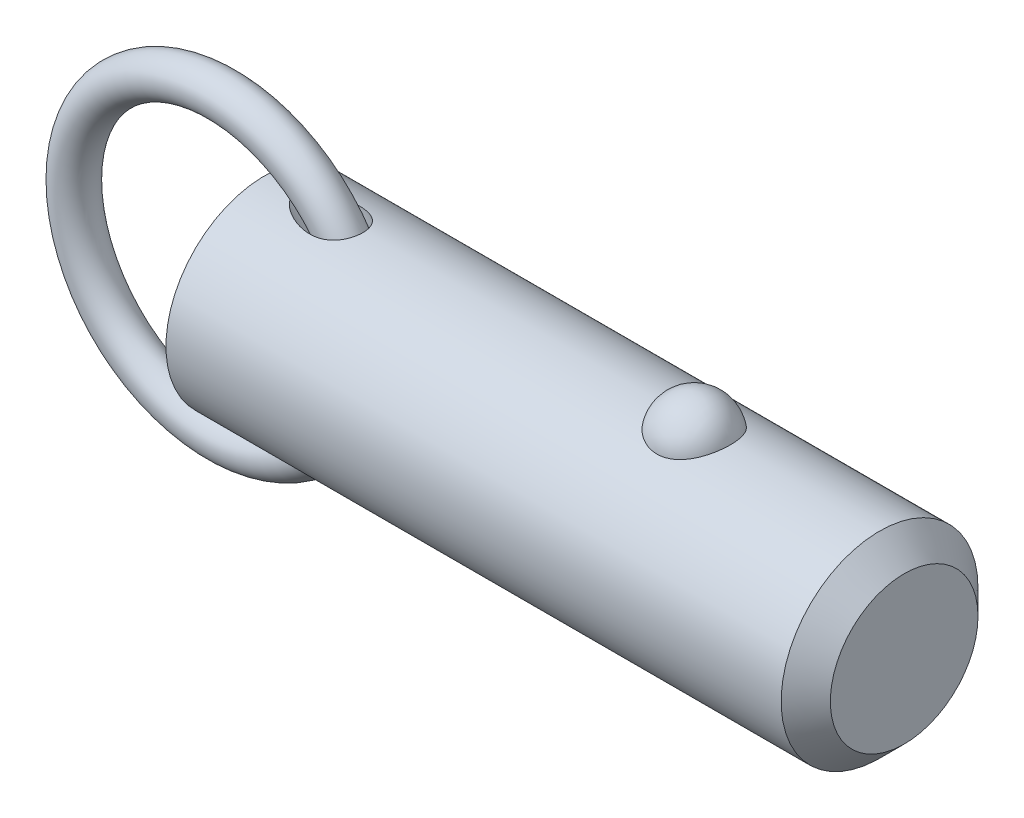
ISO-10303-21;
HEADER;
FILE_DESCRIPTION(('STEP AP214'),'2;1');
FILE_NAME('part.step','',(''),(''),'','','');
FILE_SCHEMA(('AUTOMOTIVE_DESIGN { 1 0 10303 214 1 1 1 1 }'));
ENDSEC;
DATA;
#1=APPLICATION_CONTEXT('core data for automotive mechanical design processes');
#2=APPLICATION_PROTOCOL_DEFINITION('international standard','automotive_design',2000,#1);
#3=PRODUCT_CONTEXT('',#1,'mechanical');
#4=PRODUCT('Part','Part','',(#3));
#5=PRODUCT_RELATED_PRODUCT_CATEGORY('part','',(#4));
#6=PRODUCT_DEFINITION_FORMATION('','',#4);
#7=PRODUCT_DEFINITION_CONTEXT('part definition',#1,'design');
#8=PRODUCT_DEFINITION('design','',#6,#7);
#9=PRODUCT_DEFINITION_SHAPE('','',#8);
#10=(LENGTH_UNIT() NAMED_UNIT(*) SI_UNIT(.MILLI.,.METRE.));
#11=(NAMED_UNIT(*) PLANE_ANGLE_UNIT() SI_UNIT($,.RADIAN.));
#12=(NAMED_UNIT(*) SI_UNIT($,.STERADIAN.) SOLID_ANGLE_UNIT());
#13=UNCERTAINTY_MEASURE_WITH_UNIT(LENGTH_MEASURE(1.E-05),#10,'distance_accuracy_value','');
#14=(GEOMETRIC_REPRESENTATION_CONTEXT(3) GLOBAL_UNCERTAINTY_ASSIGNED_CONTEXT((#13)) GLOBAL_UNIT_ASSIGNED_CONTEXT((#10,
#11,#12)) REPRESENTATION_CONTEXT('',''));
#15=CARTESIAN_POINT('',(0.,0.,0.));
#16=DIRECTION('',(0.,0.,1.));
#17=DIRECTION('',(1.,0.,0.));
#18=AXIS2_PLACEMENT_3D('',#15,#16,#17);
#19=CARTESIAN_POINT('',(-5.53898640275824,0.,0.));
#20=DIRECTION('',(0.,0.,1.));
#21=DIRECTION('',(1.,0.,0.));
#22=AXIS2_PLACEMENT_3D('',#19,#20,#21);
#23=TOROIDAL_SURFACE('',#22,19.05,2.54);
#24=CARTESIAN_POINT('',(16.0510135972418,0.,0.));
#25=VERTEX_POINT('',#24);
#26=VERTEX_LOOP('',#25);
#27=FACE_BOUND('',#26,.T.);
#28=ADVANCED_FACE('P0_F12',(#27),#23,.T.);
#29=CLOSED_SHELL('',(#28));
#30=MANIFOLD_SOLID_BREP('P0_B1',#29);
#31=CARTESIAN_POINT('',(0.,0.,0.));
#32=DIRECTION('',(1.,0.,0.));
#33=DIRECTION('',(0.,0.,-1.));
#34=AXIS2_PLACEMENT_3D('',#31,#32,#33);
#35=CYLINDRICAL_SURFACE('',#34,12.7);
#36=CARTESIAN_POINT('',(79.375,0.,0.));
#37=DIRECTION('',(1.,0.,0.));
#38=DIRECTION('',(0.,0.,-1.));
#39=AXIS2_PLACEMENT_3D('',#36,#37,#38);
#40=CIRCLE('',#39,12.7);
#41=CARTESIAN_POINT('',(79.375,0.,-12.7));
#42=VERTEX_POINT('',#41);
#43=EDGE_CURVE('P1_E89',#42,#42,#40,.T.);
#44=ORIENTED_EDGE('',*,*,#43,.F.);
#45=EDGE_LOOP('',(#44));
#46=FACE_BOUND('',#45,.T.);
#47=CARTESIAN_POINT('',(0.,0.,0.));
#48=DIRECTION('',(1.,0.,0.));
#49=DIRECTION('',(0.,0.,-1.));
#50=AXIS2_PLACEMENT_3D('',#47,#48,#49);
#51=CIRCLE('',#50,12.7);
#52=CARTESIAN_POINT('',(0.,0.,-12.7));
#53=VERTEX_POINT('',#52);
#54=EDGE_CURVE('P1_E52',#53,#53,#51,.T.);
#55=ORIENTED_EDGE('',*,*,#54,.T.);
#56=EDGE_LOOP('',(#55));
#57=FACE_BOUND('',#56,.T.);
#58=CARTESIAN_POINT('',(55.4600429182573,11.7500437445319,4.81938502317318));
#59=CARTESIAN_POINT('',(55.3350881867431,11.7500430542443,4.81938571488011));
#60=CARTESIAN_POINT('',(55.2101442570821,11.7520975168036,4.81438658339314));
#61=CARTESIAN_POINT('',(54.9611425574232,11.760253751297,4.79442904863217));
#62=CARTESIAN_POINT('',(54.8370850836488,11.7663568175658,4.77946746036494));
#63=CARTESIAN_POINT('',(54.5909016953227,11.7824262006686,4.73971414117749));
#64=CARTESIAN_POINT('',(54.4687744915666,11.7923898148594,4.71492928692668));
#65=CARTESIAN_POINT('',(54.2271874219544,11.8158938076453,4.65571340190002));
#66=CARTESIAN_POINT('',(54.1077285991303,11.8294355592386,4.6212786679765));
#67=CARTESIAN_POINT('',(53.8725578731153,11.8596812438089,4.54309502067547));
#68=CARTESIAN_POINT('',(53.7568393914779,11.8763792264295,4.49936361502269));
#69=CARTESIAN_POINT('',(53.5296530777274,11.9124878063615,4.40287235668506));
#70=CARTESIAN_POINT('',(53.4181868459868,11.9318994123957,4.35010914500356));
#71=CARTESIAN_POINT('',(53.0912782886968,11.9934256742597,4.17881316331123));
#72=CARTESIAN_POINT('',(52.8831270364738,12.038858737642,4.04720756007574));
#73=CARTESIAN_POINT('',(52.4858509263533,12.1352173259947,3.748564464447));
#74=CARTESIAN_POINT('',(52.2974438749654,12.1862630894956,3.58061821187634));
#75=CARTESIAN_POINT('',(51.9505213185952,12.2875163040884,3.21600758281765));
#76=CARTESIAN_POINT('',(51.7920113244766,12.3377235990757,3.0193379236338));
#77=CARTESIAN_POINT('',(51.5016887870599,12.434492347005,2.592916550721));
#78=CARTESIAN_POINT('',(51.3713762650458,12.4807925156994,2.36208286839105));
#79=CARTESIAN_POINT('',(51.1494079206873,12.5623454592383,1.88070399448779));
#80=CARTESIAN_POINT('',(51.0577554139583,12.5975972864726,1.63015711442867));
#81=CARTESIAN_POINT('',(50.9140466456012,12.6538414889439,1.11298869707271));
#82=CARTESIAN_POINT('',(50.8624990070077,12.6746503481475,0.84620552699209));
#83=CARTESIAN_POINT('',(50.8019771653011,12.699153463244,0.307085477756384));
#84=CARTESIAN_POINT('',(50.7930018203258,12.7028481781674,0.0347487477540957));
#85=CARTESIAN_POINT('',(50.8177310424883,12.6927785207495,-0.506073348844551));
#86=CARTESIAN_POINT('',(50.8511899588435,12.6791146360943,-0.774571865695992));
#87=CARTESIAN_POINT('',(50.9596877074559,12.635882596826,-1.30170246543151));
#88=CARTESIAN_POINT('',(51.0347272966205,12.6063141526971,-1.5603343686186));
#89=CARTESIAN_POINT('',(51.2250000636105,12.5342328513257,-2.06083899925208));
#90=CARTESIAN_POINT('',(51.3402872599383,12.4917026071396,-2.3026886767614));
#91=CARTESIAN_POINT('',(51.6087044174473,12.3981123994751,-2.76259600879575));
#92=CARTESIAN_POINT('',(51.7618374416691,12.3470517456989,-2.98065173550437));
#93=CARTESIAN_POINT('',(52.1035077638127,12.2416045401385,-3.38786328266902));
#94=CARTESIAN_POINT('',(52.2922017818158,12.1872040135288,-3.57688418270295));
#95=CARTESIAN_POINT('',(52.7002392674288,12.0814086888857,-3.91941073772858));
#96=CARTESIAN_POINT('',(52.9195800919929,12.0300136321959,-4.07291945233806));
#97=CARTESIAN_POINT('',(53.3783753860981,11.9373542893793,-4.33691289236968));
#98=CARTESIAN_POINT('',(53.6173044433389,11.8958982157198,-4.44824125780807));
#99=CARTESIAN_POINT('',(54.1124376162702,11.8268116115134,-4.62881985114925));
#100=CARTESIAN_POINT('',(54.3686351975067,11.7991758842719,-4.69808589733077));
#101=CARTESIAN_POINT('',(54.8771640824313,11.7622209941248,-4.78983181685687));
#102=CARTESIAN_POINT('',(55.1290414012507,11.7520502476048,-4.81449025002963));
#103=CARTESIAN_POINT('',(55.6335734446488,11.7485796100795,-4.82295735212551));
#104=CARTESIAN_POINT('',(55.8862280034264,11.7552763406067,-4.80677420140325));
#105=CARTESIAN_POINT('',(56.3768341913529,11.7842584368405,-4.73525430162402));
#106=CARTESIAN_POINT('',(56.6149984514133,11.8060486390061,-4.68116061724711));
#107=CARTESIAN_POINT('',(57.0784894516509,11.8622750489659,-4.53678133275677));
#108=CARTESIAN_POINT('',(57.3038151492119,11.8967122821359,-4.44649279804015));
#109=CARTESIAN_POINT('',(57.7408018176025,11.9754603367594,-4.2298761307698));
#110=CARTESIAN_POINT('',(57.9520579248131,12.0199699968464,-4.10280539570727));
#111=CARTESIAN_POINT('',(58.3506012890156,12.1138028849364,-3.81685409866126));
#112=CARTESIAN_POINT('',(58.5378830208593,12.163127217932,-3.65796622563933));
#113=CARTESIAN_POINT('',(58.8933509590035,12.2642343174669,-3.30364864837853));
#114=CARTESIAN_POINT('',(59.0601119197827,12.3160165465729,-3.10678783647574));
#115=CARTESIAN_POINT('',(59.3595799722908,12.4142566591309,-2.68748409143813));
#116=CARTESIAN_POINT('',(59.4922809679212,12.4607135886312,-2.46503658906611));
#117=CARTESIAN_POINT('',(59.7246912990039,12.5450236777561,-1.9928951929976));
#118=CARTESIAN_POINT('',(59.823215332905,12.5825557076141,-1.7425591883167));
#119=CARTESIAN_POINT('',(59.9792277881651,12.6431720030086,-1.22773734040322));
#120=CARTESIAN_POINT('',(60.0367157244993,12.6662560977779,-0.963251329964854));
#121=CARTESIAN_POINT('',(60.1095441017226,12.6956486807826,-0.427355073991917));
#122=CARTESIAN_POINT('',(60.1248378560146,12.7019385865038,-0.1559374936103));
#123=CARTESIAN_POINT('',(60.1127794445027,12.6970201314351,0.385928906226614));
#124=CARTESIAN_POINT('',(60.0854280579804,12.6858120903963,0.656377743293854));
#125=CARTESIAN_POINT('',(60.0130609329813,12.6568455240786,1.05454017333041));
#126=CARTESIAN_POINT('',(59.9837963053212,12.6451962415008,1.18577850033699));
#127=CARTESIAN_POINT('',(59.9150228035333,12.6181819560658,1.4451380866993));
#128=CARTESIAN_POINT('',(59.8755176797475,12.6028183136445,1.57326046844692));
#129=CARTESIAN_POINT('',(59.7864397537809,12.5687547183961,1.82554978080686));
#130=CARTESIAN_POINT('',(59.7368627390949,12.5500533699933,1.9497150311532));
#131=CARTESIAN_POINT('',(59.6279211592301,12.5098093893,2.19314370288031));
#132=CARTESIAN_POINT('',(59.5685601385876,12.4882677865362,2.31240887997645));
#133=CARTESIAN_POINT('',(59.4399712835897,12.4427679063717,2.54593031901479));
#134=CARTESIAN_POINT('',(59.3706888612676,12.4187964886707,2.66015396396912));
#135=CARTESIAN_POINT('',(59.222903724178,12.3691892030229,2.88202659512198));
#136=CARTESIAN_POINT('',(59.1444044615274,12.3435539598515,2.98967802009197));
#137=CARTESIAN_POINT('',(58.9785502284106,12.2912955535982,3.19774385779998));
#138=CARTESIAN_POINT('',(58.8911918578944,12.2646720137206,3.29815546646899));
#139=CARTESIAN_POINT('',(58.7081617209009,12.2111945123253,3.49095035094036));
#140=CARTESIAN_POINT('',(58.6124932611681,12.1843406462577,3.58333679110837));
#141=CARTESIAN_POINT('',(58.4136272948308,12.1312249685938,3.75922876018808));
#142=CARTESIAN_POINT('',(58.3104503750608,12.104961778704,3.84275713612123));
#143=CARTESIAN_POINT('',(58.0970133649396,12.0537284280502,4.00056406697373));
#144=CARTESIAN_POINT('',(57.9867562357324,12.028757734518,4.07484645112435));
#145=CARTESIAN_POINT('',(57.7597550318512,11.9808306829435,4.21367959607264));
#146=CARTESIAN_POINT('',(57.6430068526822,11.9578756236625,4.27822410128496));
#147=CARTESIAN_POINT('',(57.4039425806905,11.9147184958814,4.39698483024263));
#148=CARTESIAN_POINT('',(57.2816287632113,11.894515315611,4.45120522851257));
#149=CARTESIAN_POINT('',(57.0229527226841,11.8561129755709,4.55255353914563));
#150=CARTESIAN_POINT('',(56.8862237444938,11.8381764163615,4.59884858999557));
#151=CARTESIAN_POINT('',(56.6086087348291,11.8069093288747,4.67853897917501));
#152=CARTESIAN_POINT('',(56.4677245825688,11.7935767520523,4.71194005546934));
#153=CARTESIAN_POINT('',(56.1830944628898,11.7720277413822,4.76552188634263));
#154=CARTESIAN_POINT('',(56.0393488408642,11.7638106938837,4.78570422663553));
#155=CARTESIAN_POINT('',(55.7504114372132,11.7528195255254,4.81263433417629));
#156=CARTESIAN_POINT('',(55.6052198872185,11.7500445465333,4.81938421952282));
#157=CARTESIAN_POINT('',(55.4600429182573,11.7500437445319,4.81938502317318));
#158=B_SPLINE_CURVE_WITH_KNOTS('',3,(#58,#59,#60,#61,#62,#63,#64,#65,#66,#67,#68,#69,#70,#71,
#72,#73,#74,#75,#76,#77,#78,#79,#80,#81,#82,#83,#84,#85,#86,#87,#88,#89,#90,#91,#92,#93,#94,#95,
#96,#97,#98,#99,#100,#101,#102,#103,#104,#105,#106,#107,#108,#109,#110,#111,#112,#113,#114,#115,
#116,#117,#118,#119,#120,#121,#122,#123,#124,#125,#126,#127,#128,#129,#130,#131,#132,#133,#134,
#135,#136,#137,#138,#139,#140,#141,#142,#143,#144,#145,#146,#147,#148,#149,#150,#151,#152,#153,
#154,#155,#156,#157),.UNSPECIFIED.,.T.,.F.,(4,2,2,2,2,2,2,2,2,2,2,2,2,2,2,2,2,2,2,2,2,2,2,2,2,2,
2,2,2,2,2,2,2,2,2,2,2,2,2,2,2,2,2,2,2,2,2,2,2,4),(0.,0.374729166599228,0.749578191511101,
1.12416526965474,1.49889629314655,1.87292776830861,2.24709865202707,2.99481328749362,
3.76399449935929,4.53331735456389,5.3368391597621,6.14042986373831,6.95405296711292,
7.7676542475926,8.57656703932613,9.38549455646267,10.1955119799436,11.0055949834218,
11.8193353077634,12.6330054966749,13.4294141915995,14.2255231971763,14.9815786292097,
15.7374826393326,16.4696948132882,17.2019663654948,17.9501979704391,18.6986017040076,
19.4844704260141,20.2704797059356,21.0815215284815,21.8925729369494,22.7045213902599,
23.5164550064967,23.9209608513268,24.3253187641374,24.7298461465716,25.1342272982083,
25.54092555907,25.9474719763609,26.3541750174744,26.7607169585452,27.1661834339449,
27.5714814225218,27.9770386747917,28.3824315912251,28.8181206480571,29.2536155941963,
29.6890582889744,30.1244323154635),.UNSPECIFIED.);
#159=CARTESIAN_POINT('',(55.4600429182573,11.7500437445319,4.81938502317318));
#160=VERTEX_POINT('',#159);
#161=EDGE_CURVE('P1_E80',#160,#160,#158,.T.);
#162=ORIENTED_EDGE('',*,*,#161,.T.);
#163=EDGE_LOOP('',(#162));
#164=FACE_BOUND('',#163,.T.);
#165=CARTESIAN_POINT('',(-5.53898640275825,0.,0.));
#166=DIRECTION('',(0.796400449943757,-0.604769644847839,0.));
#167=DIRECTION('',(0.604769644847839,0.796400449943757,0.));
#168=AXIS2_PLACEMENT_3D('',#165,#166,#167);
#169=ELLIPSE('',#168,15.9467514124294,12.7);
#170=CARTESIAN_POINT('',(4.0948214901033,12.6864319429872,0.586893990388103));
#171=VERTEX_POINT('',#170);
#172=CARTESIAN_POINT('',(4.0948214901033,12.6864319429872,-0.586893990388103));
#173=VERTEX_POINT('',#172);
#174=EDGE_CURVE('P1_E47',#171,#173,#169,.F.);
#175=ORIENTED_EDGE('',*,*,#174,.T.);
#176=CARTESIAN_POINT('',(4.0615317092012,12.6905758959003,-0.489166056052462));
#177=CARTESIAN_POINT('',(4.08111374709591,12.6881366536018,-0.552489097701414));
#178=CARTESIAN_POINT('',(4.10417851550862,12.6852663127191,-0.614604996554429));
#179=CARTESIAN_POINT('',(4.15628434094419,12.6787965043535,-0.736067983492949));
#180=CARTESIAN_POINT('',(4.18531032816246,12.6751988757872,-0.795421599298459));
#181=CARTESIAN_POINT('',(4.2791115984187,12.6636052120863,-0.967590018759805));
#182=CARTESIAN_POINT('',(4.35123408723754,12.654730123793,-1.07635920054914));
#183=CARTESIAN_POINT('',(4.49106800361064,12.6376715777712,-1.25922957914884));
#184=CARTESIAN_POINT('',(4.55601066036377,12.6297947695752,-1.33556751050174));
#185=CARTESIAN_POINT('',(4.69223626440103,12.6134116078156,-1.48232741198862));
#186=CARTESIAN_POINT('',(4.76352147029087,12.6049050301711,-1.552747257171));
#187=CARTESIAN_POINT('',(4.911639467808,12.587417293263,-1.68868704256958));
#188=CARTESIAN_POINT('',(4.98851399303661,12.5784327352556,-1.75416062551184));
#189=CARTESIAN_POINT('',(5.14630057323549,12.560235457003,-1.88003275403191));
#190=CARTESIAN_POINT('',(5.22721398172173,12.5510226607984,-1.94042957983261));
#191=CARTESIAN_POINT('',(5.45368877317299,12.5256514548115,-2.09966332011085));
#192=CARTESIAN_POINT('',(5.6026161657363,12.5094182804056,-2.1937198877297));
#193=CARTESIAN_POINT('',(5.9079554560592,12.4774211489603,-2.36893890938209));
#194=CARTESIAN_POINT('',(6.06437232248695,12.4616575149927,-2.45009264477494));
#195=CARTESIAN_POINT('',(6.38306132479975,12.431227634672,-2.60008249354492));
#196=CARTESIAN_POINT('',(6.54533237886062,12.4165611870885,-2.66892086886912));
#197=CARTESIAN_POINT('',(6.8746261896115,12.3889351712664,-2.7943519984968));
#198=CARTESIAN_POINT('',(7.04164773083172,12.3759751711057,-2.85094785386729));
#199=CARTESIAN_POINT('',(7.38726647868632,12.3518460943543,-2.95377962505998));
#200=CARTESIAN_POINT('',(7.5660457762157,12.3407843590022,-2.99943209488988));
#201=CARTESIAN_POINT('',(7.9269869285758,12.3219309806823,-3.075966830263));
#202=CARTESIAN_POINT('',(8.109149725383,12.314140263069,-3.10684491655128));
#203=CARTESIAN_POINT('',(8.47511457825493,12.3025918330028,-3.152268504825));
#204=CARTESIAN_POINT('',(8.65890979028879,12.2988216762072,-3.16686440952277));
#205=CARTESIAN_POINT('',(9.02696087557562,12.2959421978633,-3.17802250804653));
#206=CARTESIAN_POINT('',(9.21121628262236,12.2968292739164,-3.17459864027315));
#207=CARTESIAN_POINT('',(9.61636263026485,12.3045198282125,-3.14471110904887));
#208=CARTESIAN_POINT('',(9.83695552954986,12.3125080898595,-3.11363232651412));
#209=CARTESIAN_POINT('',(10.1619126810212,12.3303028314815,-3.04206574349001));
#210=CARTESIAN_POINT('',(10.2692747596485,12.3372061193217,-3.01403983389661));
#211=CARTESIAN_POINT('',(10.4811758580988,12.3528538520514,-2.94925947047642));
#212=CARTESIAN_POINT('',(10.5857162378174,12.361597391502,-2.91250930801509));
#213=CARTESIAN_POINT('',(10.7921321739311,12.3808585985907,-2.82951748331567));
#214=CARTESIAN_POINT('',(10.8939665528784,12.3913944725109,-2.78317723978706));
#215=CARTESIAN_POINT('',(11.092611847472,12.4138762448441,-2.6811200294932));
#216=CARTESIAN_POINT('',(11.1894254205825,12.4258213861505,-2.62540809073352));
#217=CARTESIAN_POINT('',(11.3768740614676,12.4507225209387,-2.50465655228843));
#218=CARTESIAN_POINT('',(11.46751150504,12.4636781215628,-2.43962056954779));
#219=CARTESIAN_POINT('',(11.6414572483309,12.4901070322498,-2.30048560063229));
#220=CARTESIAN_POINT('',(11.7247669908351,12.5035802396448,-2.22638840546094));
#221=CARTESIAN_POINT('',(11.8713131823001,12.5285000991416,-2.08117367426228));
#222=CARTESIAN_POINT('',(11.9357009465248,12.5399538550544,-2.01121596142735));
#223=CARTESIAN_POINT('',(12.0576805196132,12.5624496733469,-1.86555293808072));
#224=CARTESIAN_POINT('',(12.1152732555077,12.5734917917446,-1.78984841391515));
#225=CARTESIAN_POINT('',(12.223073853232,12.5947858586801,-1.6332788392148));
#226=CARTESIAN_POINT('',(12.2732844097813,12.6050380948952,-1.55241568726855));
#227=CARTESIAN_POINT('',(12.3658430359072,12.6243983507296,-1.38621267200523));
#228=CARTESIAN_POINT('',(12.4081916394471,12.6335064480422,-1.30087311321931));
#229=CARTESIAN_POINT('',(12.5150098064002,12.6569076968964,-1.05702619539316));
#230=CARTESIAN_POINT('',(12.5703399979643,12.6695746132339,-0.894232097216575));
#231=CARTESIAN_POINT('',(12.6526225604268,12.6886816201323,-0.56139175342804));
#232=CARTESIAN_POINT('',(12.6795825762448,12.6951233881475,-0.391347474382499));
#233=CARTESIAN_POINT('',(12.7041016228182,12.7009766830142,-0.0537636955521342));
#234=CARTESIAN_POINT('',(12.7024538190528,12.7005778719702,0.113714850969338));
#235=CARTESIAN_POINT('',(12.6717240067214,12.6932548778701,0.445979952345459));
#236=CARTESIAN_POINT('',(12.6426435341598,12.6863310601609,0.610766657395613));
#237=CARTESIAN_POINT('',(12.5579769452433,12.6667465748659,0.932429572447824));
#238=CARTESIAN_POINT('',(12.5024793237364,12.6541050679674,1.08933027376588));
#239=CARTESIAN_POINT('',(12.3665691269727,12.6244558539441,1.39146752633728));
#240=CARTESIAN_POINT('',(12.2861577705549,12.6074483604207,1.53670464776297));
#241=CARTESIAN_POINT('',(12.1018203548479,12.5706804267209,1.81319588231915));
#242=CARTESIAN_POINT('',(11.9976588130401,12.5508932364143,1.94428915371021));
#243=CARTESIAN_POINT('',(11.7695265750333,12.5107540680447,2.1877605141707));
#244=CARTESIAN_POINT('',(11.6455540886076,12.4904020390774,2.30013691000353));
#245=CARTESIAN_POINT('',(11.3759347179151,12.4502278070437,2.50870972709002));
#246=CARTESIAN_POINT('',(11.2295880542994,12.4304654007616,2.60400962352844));
#247=CARTESIAN_POINT('',(10.9239803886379,12.3941696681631,2.77162929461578));
#248=CARTESIAN_POINT('',(10.7647152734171,12.3776373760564,2.84394171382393));
#249=CARTESIAN_POINT('',(10.4192039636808,12.3473062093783,2.97303525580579));
#250=CARTESIAN_POINT('',(10.231933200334,12.3340204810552,3.02717164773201));
#251=CARTESIAN_POINT('',(9.85152982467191,12.3134301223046,3.10986173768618));
#252=CARTESIAN_POINT('',(9.65839336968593,12.3061295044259,3.13839827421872));
#253=CARTESIAN_POINT('',(9.31022514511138,12.2982822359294,3.16897517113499));
#254=CARTESIAN_POINT('',(9.15555718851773,12.2966525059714,3.1752689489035));
#255=CARTESIAN_POINT('',(8.84618945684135,12.2967963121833,3.17471335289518));
#256=CARTESIAN_POINT('',(8.69148970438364,12.2985715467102,3.16785742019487));
#257=CARTESIAN_POINT('',(8.38280471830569,12.3051648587,3.14214692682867));
#258=CARTESIAN_POINT('',(8.22882218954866,12.3099904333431,3.12326280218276));
#259=CARTESIAN_POINT('',(7.92276070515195,12.3222644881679,3.07448013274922));
#260=CARTESIAN_POINT('',(7.77068148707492,12.3297126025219,3.04458312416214));
#261=CARTESIAN_POINT('',(7.46452663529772,12.3470493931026,2.97350781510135));
#262=CARTESIAN_POINT('',(7.31052714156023,12.3570043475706,2.93201910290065));
#263=CARTESIAN_POINT('',(7.00579083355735,12.3787609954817,2.83876185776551));
#264=CARTESIAN_POINT('',(6.85505451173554,12.3905629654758,2.78699178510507));
#265=CARTESIAN_POINT('',(6.55781208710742,12.415528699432,2.67357744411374));
#266=CARTESIAN_POINT('',(6.41129783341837,12.4286895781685,2.6119539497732));
#267=CARTESIAN_POINT('',(6.12302950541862,12.4559398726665,2.47874512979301));
#268=CARTESIAN_POINT('',(5.9812739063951,12.4700289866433,2.40716303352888));
#269=CARTESIAN_POINT('',(5.67073126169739,12.5020754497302,2.23550426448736));
#270=CARTESIAN_POINT('',(5.50343839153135,12.5201625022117,2.13268685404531));
#271=CARTESIAN_POINT('',(5.26147616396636,12.5471537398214,1.96522579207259));
#272=CARTESIAN_POINT('',(5.18224299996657,12.5561365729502,1.90713440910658));
#273=CARTESIAN_POINT('',(5.02746475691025,12.573912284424,1.78618989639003));
#274=CARTESIAN_POINT('',(4.95191912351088,12.5827051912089,1.72333748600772));
#275=CARTESIAN_POINT('',(4.81787163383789,12.598469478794,1.60360864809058));
#276=CARTESIAN_POINT('',(4.75865966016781,12.6054958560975,1.54753994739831));
#277=CARTESIAN_POINT('',(4.64406285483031,12.6191906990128,1.43158546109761));
#278=CARTESIAN_POINT('',(4.58867926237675,12.6258590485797,1.37169845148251));
#279=CARTESIAN_POINT('',(4.43014912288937,12.6450546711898,1.18656670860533));
#280=CARTESIAN_POINT('',(4.33372726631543,12.6568788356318,1.05507993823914));
#281=CARTESIAN_POINT('',(4.21252055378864,12.6718304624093,0.848052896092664));
#282=CARTESIAN_POINT('',(4.17660155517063,12.6762773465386,0.779100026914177));
#283=CARTESIAN_POINT('',(4.11264979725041,12.6842122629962,0.637080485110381));
#284=CARTESIAN_POINT('',(4.08466792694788,12.6876941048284,0.563990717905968));
#285=CARTESIAN_POINT('',(4.0615317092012,12.6905758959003,0.489166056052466));
#286=B_SPLINE_CURVE_WITH_KNOTS('',3,(#176,#177,#178,#179,#180,#181,#182,#183,#184,#185,#186,
#187,#188,#189,#190,#191,#192,#193,#194,#195,#196,#197,#198,#199,#200,#201,#202,#203,#204,#205,
#206,#207,#208,#209,#210,#211,#212,#213,#214,#215,#216,#217,#218,#219,#220,#221,#222,#223,#224,
#225,#226,#227,#228,#229,#230,#231,#232,#233,#234,#235,#236,#237,#238,#239,#240,#241,#242,#243,
#244,#245,#246,#247,#248,#249,#250,#251,#252,#253,#254,#255,#256,#257,#258,#259,#260,#261,#262,
#263,#264,#265,#266,#267,#268,#269,#270,#271,#272,#273,#274,#275,#276,#277,#278,#279,#280,#281,
#282,#283,#284,#285),.UNSPECIFIED.,.F.,.F.,(4,2,2,2,2,2,2,2,2,2,2,2,2,2,2,2,2,2,2,2,2,2,2,2,2,2,
2,2,2,2,2,2,2,2,2,2,2,2,2,2,2,2,2,2,2,2,2,2,2,2,2,2,2,2,4),(0.,0.198708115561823,
0.396919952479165,0.787580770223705,1.08882492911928,1.39017679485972,1.6940713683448,
1.99806847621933,2.52793143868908,3.05815092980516,3.58827293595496,4.11826050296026,
4.67218806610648,5.22627222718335,5.77863637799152,6.33057333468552,6.99657211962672,
7.32977411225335,7.66281254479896,7.99946156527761,8.33593054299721,8.67226935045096,
9.00854178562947,9.29544181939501,9.58230266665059,9.86905853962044,10.155794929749,
10.6702338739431,11.1845341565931,11.6845985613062,12.1846349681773,12.6830079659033,
13.1813565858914,13.68487951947,14.1884479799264,14.713533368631,15.2387866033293,
15.8228373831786,16.407279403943,16.8710810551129,17.3351141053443,17.8002921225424,
18.2654052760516,18.7444169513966,19.2235004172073,19.7015868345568,20.1795185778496,
20.7699825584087,21.0658110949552,21.3615950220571,21.6069574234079,21.8523988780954,
22.3397467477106,22.5729183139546,22.8075527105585),.UNSPECIFIED.);
#287=EDGE_CURVE('P1_E51',#173,#171,#286,.T.);
#288=ORIENTED_EDGE('',*,*,#287,.T.);
#289=EDGE_LOOP('',(#175,#288));
#290=FACE_BOUND('',#289,.T.);
#291=CARTESIAN_POINT('',(-5.53898640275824,0.,0.));
#292=DIRECTION('',(-0.796400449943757,-0.604769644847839,0.));
#293=DIRECTION('',(0.604769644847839,-0.796400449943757,0.));
#294=AXIS2_PLACEMENT_3D('',#291,#292,#293);
#295=ELLIPSE('',#294,15.9467514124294,12.7);
#296=CARTESIAN_POINT('',(4.09482149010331,-12.6864319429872,0.586893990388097));
#297=VERTEX_POINT('',#296);
#298=CARTESIAN_POINT('',(4.09482149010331,-12.6864319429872,-0.586893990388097));
#299=VERTEX_POINT('',#298);
#300=EDGE_CURVE('P1_E28',#297,#299,#295,.F.);
#301=ORIENTED_EDGE('',*,*,#300,.F.);
#302=CARTESIAN_POINT('',(4.0615317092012,-12.6905758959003,0.489166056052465));
#303=CARTESIAN_POINT('',(4.08111374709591,-12.6881366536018,0.552489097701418));
#304=CARTESIAN_POINT('',(4.10417851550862,-12.6852663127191,0.614604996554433));
#305=CARTESIAN_POINT('',(4.15628434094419,-12.6787965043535,0.736067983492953));
#306=CARTESIAN_POINT('',(4.18531032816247,-12.6751988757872,0.795421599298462));
#307=CARTESIAN_POINT('',(4.2791115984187,-12.6636052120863,0.967590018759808));
#308=CARTESIAN_POINT('',(4.35123408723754,-12.654730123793,1.07635920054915));
#309=CARTESIAN_POINT('',(4.49106800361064,-12.6376715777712,1.25922957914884));
#310=CARTESIAN_POINT('',(4.55601066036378,-12.6297947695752,1.33556751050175));
#311=CARTESIAN_POINT('',(4.69223626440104,-12.6134116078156,1.48232741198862));
#312=CARTESIAN_POINT('',(4.76352147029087,-12.6049050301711,1.552747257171));
#313=CARTESIAN_POINT('',(4.911639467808,-12.587417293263,1.68868704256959));
#314=CARTESIAN_POINT('',(4.98851399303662,-12.5784327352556,1.75416062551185));
#315=CARTESIAN_POINT('',(5.1463005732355,-12.560235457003,1.88003275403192));
#316=CARTESIAN_POINT('',(5.22721398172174,-12.5510226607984,1.94042957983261));
#317=CARTESIAN_POINT('',(5.453688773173,-12.5256514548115,2.09966332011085));
#318=CARTESIAN_POINT('',(5.60261616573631,-12.5094182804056,2.19371988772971));
#319=CARTESIAN_POINT('',(5.90795545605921,-12.4774211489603,2.36893890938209));
#320=CARTESIAN_POINT('',(6.06437232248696,-12.4616575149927,2.45009264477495));
#321=CARTESIAN_POINT('',(6.38306132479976,-12.431227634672,2.60008249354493));
#322=CARTESIAN_POINT('',(6.54533237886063,-12.4165611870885,2.66892086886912));
#323=CARTESIAN_POINT('',(6.87462618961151,-12.3889351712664,2.79435199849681));
#324=CARTESIAN_POINT('',(7.04164773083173,-12.3759751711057,2.85094785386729));
#325=CARTESIAN_POINT('',(7.38726647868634,-12.3518460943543,2.95377962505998));
#326=CARTESIAN_POINT('',(7.56604577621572,-12.3407843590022,2.99943209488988));
#327=CARTESIAN_POINT('',(7.92698692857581,-12.3219309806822,3.075966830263));
#328=CARTESIAN_POINT('',(8.10914972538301,-12.314140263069,3.10684491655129));
#329=CARTESIAN_POINT('',(8.47511457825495,-12.3025918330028,3.152268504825));
#330=CARTESIAN_POINT('',(8.65890979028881,-12.2988216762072,3.16686440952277));
#331=CARTESIAN_POINT('',(9.02696087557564,-12.2959421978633,3.17802250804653));
#332=CARTESIAN_POINT('',(9.21121628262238,-12.2968292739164,3.17459864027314));
#333=CARTESIAN_POINT('',(9.61636263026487,-12.3045198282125,3.14471110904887));
#334=CARTESIAN_POINT('',(9.83695552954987,-12.3125080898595,3.11363232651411));
#335=CARTESIAN_POINT('',(10.1619126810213,-12.3303028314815,3.04206574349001));
#336=CARTESIAN_POINT('',(10.2692747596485,-12.3372061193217,3.01403983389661));
#337=CARTESIAN_POINT('',(10.4811758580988,-12.3528538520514,2.94925947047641));
#338=CARTESIAN_POINT('',(10.5857162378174,-12.361597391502,2.91250930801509));
#339=CARTESIAN_POINT('',(10.7921321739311,-12.3808585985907,2.82951748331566));
#340=CARTESIAN_POINT('',(10.8939665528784,-12.3913944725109,2.78317723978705));
#341=CARTESIAN_POINT('',(11.092611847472,-12.4138762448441,2.6811200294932));
#342=CARTESIAN_POINT('',(11.1894254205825,-12.4258213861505,2.62540809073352));
#343=CARTESIAN_POINT('',(11.3768740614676,-12.4507225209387,2.50465655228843));
#344=CARTESIAN_POINT('',(11.46751150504,-12.4636781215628,2.43962056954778));
#345=CARTESIAN_POINT('',(11.6414572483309,-12.4901070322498,2.30048560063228));
#346=CARTESIAN_POINT('',(11.7247669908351,-12.5035802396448,2.22638840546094));
#347=CARTESIAN_POINT('',(11.8713131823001,-12.5285000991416,2.08117367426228));
#348=CARTESIAN_POINT('',(11.9357009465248,-12.5399538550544,2.01121596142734));
#349=CARTESIAN_POINT('',(12.0576805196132,-12.5624496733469,1.86555293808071));
#350=CARTESIAN_POINT('',(12.1152732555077,-12.5734917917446,1.78984841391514));
#351=CARTESIAN_POINT('',(12.223073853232,-12.5947858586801,1.63327883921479));
#352=CARTESIAN_POINT('',(12.2732844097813,-12.6050380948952,1.55241568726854));
#353=CARTESIAN_POINT('',(12.3658430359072,-12.6243983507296,1.38621267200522));
#354=CARTESIAN_POINT('',(12.4081916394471,-12.6335064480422,1.3008731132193));
#355=CARTESIAN_POINT('',(12.5150098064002,-12.6569076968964,1.05702619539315));
#356=CARTESIAN_POINT('',(12.5703399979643,-12.6695746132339,0.894232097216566));
#357=CARTESIAN_POINT('',(12.6526225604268,-12.6886816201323,0.561391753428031));
#358=CARTESIAN_POINT('',(12.6795825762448,-12.6951233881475,0.391347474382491));
#359=CARTESIAN_POINT('',(12.7041016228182,-12.7009766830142,0.0537636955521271));
#360=CARTESIAN_POINT('',(12.7024538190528,-12.7005778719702,-0.113714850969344));
#361=CARTESIAN_POINT('',(12.6717240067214,-12.6932548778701,-0.445979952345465));
#362=CARTESIAN_POINT('',(12.6426435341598,-12.6863310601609,-0.61076665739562));
#363=CARTESIAN_POINT('',(12.5579769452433,-12.6667465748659,-0.932429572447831));
#364=CARTESIAN_POINT('',(12.5024793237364,-12.6541050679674,-1.08933027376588));
#365=CARTESIAN_POINT('',(12.3665691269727,-12.6244558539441,-1.39146752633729));
#366=CARTESIAN_POINT('',(12.2861577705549,-12.6074483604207,-1.53670464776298));
#367=CARTESIAN_POINT('',(12.1018203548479,-12.5706804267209,-1.81319588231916));
#368=CARTESIAN_POINT('',(11.9976588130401,-12.5508932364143,-1.94428915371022));
#369=CARTESIAN_POINT('',(11.7695265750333,-12.5107540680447,-2.1877605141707));
#370=CARTESIAN_POINT('',(11.6455540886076,-12.4904020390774,-2.30013691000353));
#371=CARTESIAN_POINT('',(11.3759347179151,-12.4502278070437,-2.50870972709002));
#372=CARTESIAN_POINT('',(11.2295880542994,-12.4304654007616,-2.60400962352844));
#373=CARTESIAN_POINT('',(10.9239803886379,-12.3941696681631,-2.77162929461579));
#374=CARTESIAN_POINT('',(10.7647152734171,-12.3776373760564,-2.84394171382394));
#375=CARTESIAN_POINT('',(10.4192039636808,-12.3473062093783,-2.97303525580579));
#376=CARTESIAN_POINT('',(10.231933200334,-12.3340204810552,-3.02717164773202));
#377=CARTESIAN_POINT('',(9.85152982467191,-12.3134301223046,-3.10986173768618));
#378=CARTESIAN_POINT('',(9.65839336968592,-12.3061295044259,-3.13839827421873));
#379=CARTESIAN_POINT('',(9.31022514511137,-12.2982822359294,-3.16897517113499));
#380=CARTESIAN_POINT('',(9.15555718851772,-12.2966525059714,-3.17526894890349));
#381=CARTESIAN_POINT('',(8.84618945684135,-12.2967963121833,-3.17471335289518));
#382=CARTESIAN_POINT('',(8.69148970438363,-12.2985715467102,-3.16785742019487));
#383=CARTESIAN_POINT('',(8.38280471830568,-12.3051648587,-3.14214692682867));
#384=CARTESIAN_POINT('',(8.22882218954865,-12.3099904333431,-3.12326280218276));
#385=CARTESIAN_POINT('',(7.92276070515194,-12.3222644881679,-3.07448013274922));
#386=CARTESIAN_POINT('',(7.77068148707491,-12.3297126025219,-3.04458312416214));
#387=CARTESIAN_POINT('',(7.46452663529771,-12.3470493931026,-2.97350781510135));
#388=CARTESIAN_POINT('',(7.31052714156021,-12.3570043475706,-2.93201910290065));
#389=CARTESIAN_POINT('',(7.00579083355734,-12.3787609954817,-2.83876185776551));
#390=CARTESIAN_POINT('',(6.85505451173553,-12.3905629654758,-2.78699178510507));
#391=CARTESIAN_POINT('',(6.5578120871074,-12.415528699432,-2.67357744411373));
#392=CARTESIAN_POINT('',(6.41129783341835,-12.4286895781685,-2.6119539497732));
#393=CARTESIAN_POINT('',(6.12302950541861,-12.4559398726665,-2.478745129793));
#394=CARTESIAN_POINT('',(5.98127390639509,-12.4700289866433,-2.40716303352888));
#395=CARTESIAN_POINT('',(5.67073126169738,-12.5020754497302,-2.23550426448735));
#396=CARTESIAN_POINT('',(5.50343839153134,-12.5201625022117,-2.1326868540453));
#397=CARTESIAN_POINT('',(5.26147616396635,-12.5471537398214,-1.96522579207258));
#398=CARTESIAN_POINT('',(5.18224299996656,-12.5561365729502,-1.90713440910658));
#399=CARTESIAN_POINT('',(5.02746475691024,-12.573912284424,-1.78618989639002));
#400=CARTESIAN_POINT('',(4.95191912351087,-12.5827051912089,-1.72333748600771));
#401=CARTESIAN_POINT('',(4.81787163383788,-12.598469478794,-1.60360864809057));
#402=CARTESIAN_POINT('',(4.7586596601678,-12.6054958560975,-1.5475399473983));
#403=CARTESIAN_POINT('',(4.64406285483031,-12.6191906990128,-1.43158546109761));
#404=CARTESIAN_POINT('',(4.58867926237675,-12.6258590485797,-1.37169845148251));
#405=CARTESIAN_POINT('',(4.43014912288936,-12.6450546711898,-1.18656670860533));
#406=CARTESIAN_POINT('',(4.33372726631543,-12.6568788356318,-1.05507993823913));
#407=CARTESIAN_POINT('',(4.21252055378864,-12.6718304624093,-0.848052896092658));
#408=CARTESIAN_POINT('',(4.17660155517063,-12.6762773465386,-0.779100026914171));
#409=CARTESIAN_POINT('',(4.11264979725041,-12.6842122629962,-0.637080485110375));
#410=CARTESIAN_POINT('',(4.08466792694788,-12.6876941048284,-0.563990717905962));
#411=CARTESIAN_POINT('',(4.06153170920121,-12.6905758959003,-0.48916605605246));
#412=B_SPLINE_CURVE_WITH_KNOTS('',3,(#302,#303,#304,#305,#306,#307,#308,#309,#310,#311,#312,
#313,#314,#315,#316,#317,#318,#319,#320,#321,#322,#323,#324,#325,#326,#327,#328,#329,#330,#331,
#332,#333,#334,#335,#336,#337,#338,#339,#340,#341,#342,#343,#344,#345,#346,#347,#348,#349,#350,
#351,#352,#353,#354,#355,#356,#357,#358,#359,#360,#361,#362,#363,#364,#365,#366,#367,#368,#369,
#370,#371,#372,#373,#374,#375,#376,#377,#378,#379,#380,#381,#382,#383,#384,#385,#386,#387,#388,
#389,#390,#391,#392,#393,#394,#395,#396,#397,#398,#399,#400,#401,#402,#403,#404,#405,#406,#407,
#408,#409,#410,#411),.UNSPECIFIED.,.F.,.F.,(4,2,2,2,2,2,2,2,2,2,2,2,2,2,2,2,2,2,2,2,2,2,2,2,2,2,
2,2,2,2,2,2,2,2,2,2,2,2,2,2,2,2,2,2,2,2,2,2,2,2,2,2,2,2,4),(0.,0.198708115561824,
0.396919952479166,0.787580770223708,1.08882492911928,1.39017679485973,1.69407136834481,
1.99806847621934,2.52793143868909,3.05815092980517,3.58827293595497,4.11826050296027,
4.67218806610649,5.22627222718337,5.77863637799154,6.33057333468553,6.99657211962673,
7.32977411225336,7.66281254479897,7.99946156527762,8.33593054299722,8.67226935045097,
9.00854178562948,9.29544181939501,9.5823026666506,9.86905853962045,10.155794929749,
10.6702338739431,11.1845341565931,11.6845985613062,12.1846349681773,12.6830079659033,
13.1813565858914,13.68487951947,14.1884479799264,14.713533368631,15.2387866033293,
15.8228373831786,16.407279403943,16.8710810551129,17.3351141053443,17.8002921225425,
18.2654052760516,18.7444169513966,19.2235004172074,19.7015868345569,20.1795185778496,
20.7699825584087,21.0658110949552,21.3615950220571,21.6069574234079,21.8523988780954,
22.3397467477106,22.5729183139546,22.8075527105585),.UNSPECIFIED.);
#413=EDGE_CURVE('P1_E10',#297,#299,#412,.T.);
#414=ORIENTED_EDGE('',*,*,#413,.T.);
#415=EDGE_LOOP('',(#301,#414));
#416=FACE_BOUND('',#415,.T.);
#417=ADVANCED_FACE('P1_F15',(#46,#57,#164,#290,#416),#35,.T.);
#418=CARTESIAN_POINT('',(0.,0.,0.));
#419=DIRECTION('',(-1.,0.,0.));
#420=DIRECTION('',(0.,0.,1.));
#421=AXIS2_PLACEMENT_3D('',#418,#419,#420);
#422=PLANE('',#421);
#423=ORIENTED_EDGE('',*,*,#54,.F.);
#424=EDGE_LOOP('',(#423));
#425=FACE_BOUND('',#424,.T.);
#426=ADVANCED_FACE('P1_F17',(#425),#422,.T.);
#427=CARTESIAN_POINT('',(82.55,0.,0.));
#428=DIRECTION('',(-1.,0.,0.));
#429=DIRECTION('',(0.,0.,1.));
#430=AXIS2_PLACEMENT_3D('',#427,#428,#429);
#431=CONICAL_SURFACE('',#430,9.52500000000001,0.785398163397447);
#432=ORIENTED_EDGE('',*,*,#43,.T.);
#433=EDGE_LOOP('',(#432));
#434=FACE_BOUND('',#433,.T.);
#435=CARTESIAN_POINT('',(82.55,0.,0.));
#436=DIRECTION('',(1.,0.,0.));
#437=DIRECTION('',(0.,0.,-1.));
#438=AXIS2_PLACEMENT_3D('',#435,#436,#437);
#439=CIRCLE('',#438,9.52500000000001);
#440=CARTESIAN_POINT('',(82.55,0.,-9.52500000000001));
#441=VERTEX_POINT('',#440);
#442=EDGE_CURVE('P1_E86',#441,#441,#439,.T.);
#443=ORIENTED_EDGE('',*,*,#442,.F.);
#444=EDGE_LOOP('',(#443));
#445=FACE_BOUND('',#444,.T.);
#446=ADVANCED_FACE('P1_F105',(#434,#445),#431,.T.);
#447=CARTESIAN_POINT('',(82.55,9.52500000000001,0.));
#448=DIRECTION('',(1.,0.,0.));
#449=DIRECTION('',(0.,0.,-1.));
#450=AXIS2_PLACEMENT_3D('',#447,#448,#449);
#451=PLANE('',#450);
#452=ORIENTED_EDGE('',*,*,#442,.T.);
#453=EDGE_LOOP('',(#452));
#454=FACE_BOUND('',#453,.T.);
#455=ADVANCED_FACE('P1_F78',(#454),#451,.T.);
#456=CARTESIAN_POINT('',(55.4600429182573,11.43,0.));
#457=DIRECTION('',(-1.,0.,0.));
#458=DIRECTION('',(0.,-1.,0.));
#459=AXIS2_PLACEMENT_3D('',#456,#457,#458);
#460=SPHERICAL_SURFACE('',#459,4.83);
#461=ORIENTED_EDGE('',*,*,#161,.F.);
#462=EDGE_LOOP('',(#461));
#463=FACE_BOUND('',#462,.T.);
#464=ADVANCED_FACE('P1_F71',(#463),#460,.T.);
#465=CARTESIAN_POINT('',(-5.53898640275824,0.,0.));
#466=DIRECTION('',(0.,0.,1.));
#467=DIRECTION('',(1.,0.,0.));
#468=AXIS2_PLACEMENT_3D('',#465,#466,#467);
#469=TOROIDAL_SURFACE('',#468,19.05,3.175);
#470=CARTESIAN_POINT('',(5.9818753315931,-15.1714285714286,0.));
#471=DIRECTION('',(-0.796400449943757,-0.604769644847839,0.));
#472=DIRECTION('',(0.604769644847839,-0.796400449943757,0.));
#473=AXIS2_PLACEMENT_3D('',#470,#471,#472);
#474=CIRCLE('',#473,3.175);
#475=EDGE_CURVE('P1_E34',#297,#299,#474,.T.);
#476=ORIENTED_EDGE('',*,*,#475,.T.);
#477=ORIENTED_EDGE('',*,*,#413,.F.);
#478=EDGE_LOOP('',(#476,#477));
#479=FACE_BOUND('',#478,.T.);
#480=CARTESIAN_POINT('',(5.98187533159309,15.1714285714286,0.));
#481=DIRECTION('',(0.796400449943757,-0.604769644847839,0.));
#482=DIRECTION('',(0.604769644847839,0.796400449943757,0.));
#483=AXIS2_PLACEMENT_3D('',#480,#481,#482);
#484=CIRCLE('',#483,3.175);
#485=EDGE_CURVE('P1_E41',#171,#173,#484,.T.);
#486=ORIENTED_EDGE('',*,*,#485,.F.);
#487=ORIENTED_EDGE('',*,*,#287,.F.);
#488=EDGE_LOOP('',(#486,#487));
#489=FACE_BOUND('',#488,.T.);
#490=ADVANCED_FACE('P1_F55',(#479,#489),#469,.F.);
#491=CARTESIAN_POINT('',(5.9818753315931,-15.1714285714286,0.));
#492=DIRECTION('',(-0.796400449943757,-0.604769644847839,0.));
#493=DIRECTION('',(0.604769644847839,-0.796400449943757,0.));
#494=AXIS2_PLACEMENT_3D('',#491,#492,#493);
#495=PLANE('',#494);
#496=ORIENTED_EDGE('',*,*,#300,.T.);
#497=ORIENTED_EDGE('',*,*,#475,.F.);
#498=EDGE_LOOP('',(#496,#497));
#499=FACE_BOUND('',#498,.T.);
#500=ADVANCED_FACE('P1_F70',(#499),#495,.F.);
#501=CARTESIAN_POINT('',(5.98187533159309,15.1714285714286,0.));
#502=DIRECTION('',(0.796400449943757,-0.604769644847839,0.));
#503=DIRECTION('',(0.604769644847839,0.796400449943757,0.));
#504=AXIS2_PLACEMENT_3D('',#501,#502,#503);
#505=PLANE('',#504);
#506=ORIENTED_EDGE('',*,*,#485,.T.);
#507=ORIENTED_EDGE('',*,*,#174,.F.);
#508=EDGE_LOOP('',(#506,#507));
#509=FACE_BOUND('',#508,.T.);
#510=ADVANCED_FACE('P1_F48',(#509),#505,.T.);
#511=CLOSED_SHELL('',(#417,#426,#446,#455,#464,#490,#500,#510));
#512=MANIFOLD_SOLID_BREP('P1_B1',#511);
#513=ADVANCED_BREP_SHAPE_REPRESENTATION('',(#18,#30,#512),#14);
#514=SHAPE_DEFINITION_REPRESENTATION(#9,#513);
ENDSEC;
END-ISO-10303-21;
